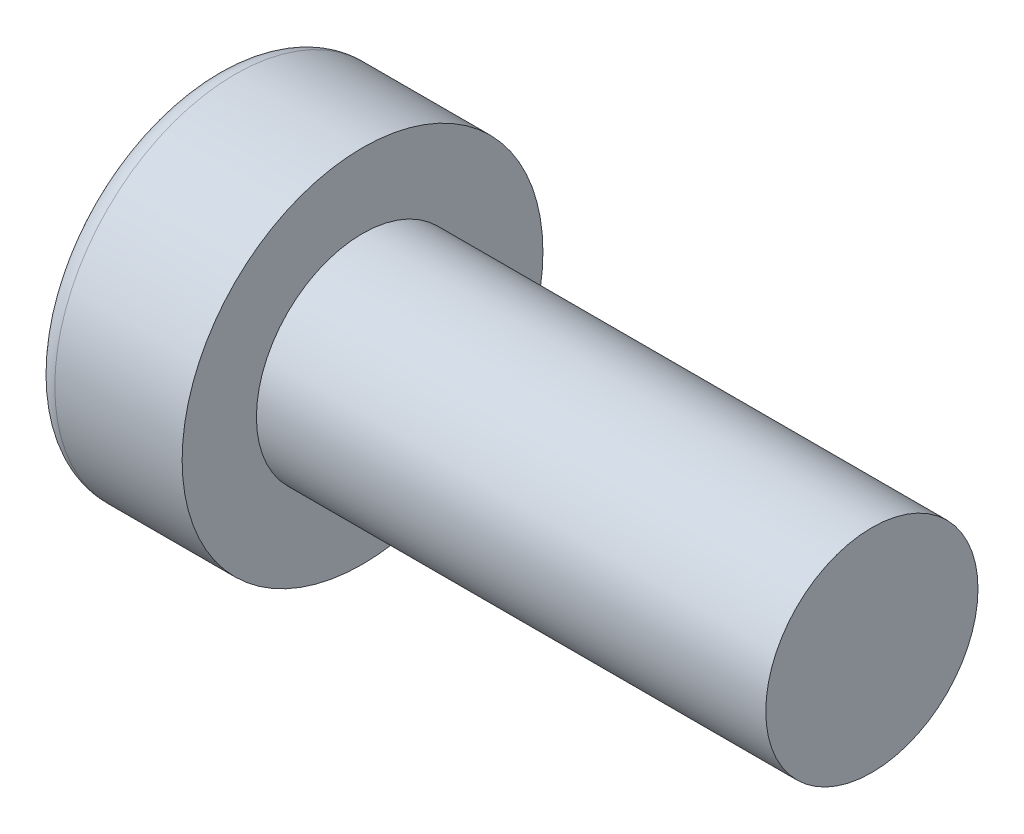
ISO-10303-21;
HEADER;
FILE_DESCRIPTION(('STEP AP214'),'2;1');
FILE_NAME('part.step','',(''),(''),'','','');
FILE_SCHEMA(('AUTOMOTIVE_DESIGN { 1 0 10303 214 1 1 1 1 }'));
ENDSEC;
DATA;
#1=APPLICATION_CONTEXT('core data for automotive mechanical design processes');
#2=APPLICATION_PROTOCOL_DEFINITION('international standard','automotive_design',2000,#1);
#3=PRODUCT_CONTEXT('',#1,'mechanical');
#4=PRODUCT('Part','Part','',(#3));
#5=PRODUCT_RELATED_PRODUCT_CATEGORY('part','',(#4));
#6=PRODUCT_DEFINITION_FORMATION('','',#4);
#7=PRODUCT_DEFINITION_CONTEXT('part definition',#1,'design');
#8=PRODUCT_DEFINITION('design','',#6,#7);
#9=PRODUCT_DEFINITION_SHAPE('','',#8);
#10=(LENGTH_UNIT() NAMED_UNIT(*) SI_UNIT(.MILLI.,.METRE.));
#11=(NAMED_UNIT(*) PLANE_ANGLE_UNIT() SI_UNIT($,.RADIAN.));
#12=(NAMED_UNIT(*) SI_UNIT($,.STERADIAN.) SOLID_ANGLE_UNIT());
#13=UNCERTAINTY_MEASURE_WITH_UNIT(LENGTH_MEASURE(1.E-05),#10,'distance_accuracy_value','');
#14=(GEOMETRIC_REPRESENTATION_CONTEXT(3) GLOBAL_UNCERTAINTY_ASSIGNED_CONTEXT((#13)) GLOBAL_UNIT_ASSIGNED_CONTEXT((#10,
#11,#12)) REPRESENTATION_CONTEXT('',''));
#15=CARTESIAN_POINT('',(0.,0.,0.));
#16=DIRECTION('',(0.,0.,1.));
#17=DIRECTION('',(1.,0.,0.));
#18=AXIS2_PLACEMENT_3D('',#15,#16,#17);
#19=CARTESIAN_POINT('',(-12.,4.25,0.));
#20=DIRECTION('',(-1.,0.,0.));
#21=DIRECTION('',(0.,0.,1.));
#22=AXIS2_PLACEMENT_3D('',#19,#20,#21);
#23=PLANE('',#22);
#24=CARTESIAN_POINT('',(-12.,0.,0.));
#25=DIRECTION('',(-1.,0.,0.));
#26=DIRECTION('',(0.,0.,1.));
#27=AXIS2_PLACEMENT_3D('',#24,#25,#26);
#28=CIRCLE('',#27,4.25);
#29=CARTESIAN_POINT('',(-12.,0.,4.25));
#30=VERTEX_POINT('',#29);
#31=EDGE_CURVE('E150',#30,#30,#28,.T.);
#32=ORIENTED_EDGE('',*,*,#31,.F.);
#33=EDGE_LOOP('',(#32));
#34=FACE_BOUND('',#33,.T.);
#35=CARTESIAN_POINT('',(-12.,0.,0.));
#36=DIRECTION('',(-1.,0.,0.));
#37=DIRECTION('',(0.,0.,1.));
#38=AXIS2_PLACEMENT_3D('',#35,#36,#37);
#39=CIRCLE('',#38,2.5);
#40=CARTESIAN_POINT('',(-12.,0.,2.5));
#41=VERTEX_POINT('',#40);
#42=EDGE_CURVE('E139',#41,#41,#39,.T.);
#43=ORIENTED_EDGE('',*,*,#42,.T.);
#44=EDGE_LOOP('',(#43));
#45=FACE_BOUND('',#44,.T.);
#46=ADVANCED_FACE('F37',(#34,#45),#23,.F.);
#47=CARTESIAN_POINT('',(-65.0118083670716,0.,0.));
#48=DIRECTION('',(-1.,0.,0.));
#49=DIRECTION('',(0.,0.,1.));
#50=AXIS2_PLACEMENT_3D('',#47,#48,#49);
#51=CYLINDRICAL_SURFACE('',#50,4.25);
#52=CARTESIAN_POINT('',(-15.,0.,0.));
#53=DIRECTION('',(1.,0.,0.));
#54=DIRECTION('',(0.,0.,-1.));
#55=AXIS2_PLACEMENT_3D('',#52,#53,#54);
#56=CIRCLE('',#55,4.25);
#57=CARTESIAN_POINT('',(-15.,0.,-4.25));
#58=VERTEX_POINT('',#57);
#59=EDGE_CURVE('E11',#58,#58,#56,.T.);
#60=ORIENTED_EDGE('',*,*,#59,.T.);
#61=EDGE_LOOP('',(#60));
#62=FACE_BOUND('',#61,.T.);
#63=ORIENTED_EDGE('',*,*,#31,.T.);
#64=EDGE_LOOP('',(#63));
#65=FACE_BOUND('',#64,.T.);
#66=ADVANCED_FACE('F172',(#62,#65),#51,.T.);
#67=CARTESIAN_POINT('',(-15.5,0.,0.));
#68=DIRECTION('',(1.,0.,0.));
#69=DIRECTION('',(0.,0.,-1.));
#70=AXIS2_PLACEMENT_3D('',#67,#68,#69);
#71=PLANE('',#70);
#72=DIRECTION('',(0.,0.5,-0.866025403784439));
#73=VECTOR('',#72,1.);
#74=CARTESIAN_POINT('',(-15.5,0.866025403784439,1.5));
#75=LINE('',#74,#73);
#76=CARTESIAN_POINT('',(-15.5,0.866025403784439,1.5));
#77=VERTEX_POINT('',#76);
#78=CARTESIAN_POINT('',(-15.5,1.73205080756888,0.));
#79=VERTEX_POINT('',#78);
#80=EDGE_CURVE('E126',#77,#79,#75,.T.);
#81=ORIENTED_EDGE('',*,*,#80,.F.);
#82=DIRECTION('',(0.,1.,0.));
#83=VECTOR('',#82,1.);
#84=CARTESIAN_POINT('',(-15.5,-0.866025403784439,1.5));
#85=LINE('',#84,#83);
#86=CARTESIAN_POINT('',(-15.5,-0.866025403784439,1.5));
#87=VERTEX_POINT('',#86);
#88=EDGE_CURVE('E52',#87,#77,#85,.T.);
#89=ORIENTED_EDGE('',*,*,#88,.F.);
#90=DIRECTION('',(0.,0.5,0.866025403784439));
#91=VECTOR('',#90,1.);
#92=CARTESIAN_POINT('',(-15.5,-1.73205080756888,0.));
#93=LINE('',#92,#91);
#94=CARTESIAN_POINT('',(-15.5,-1.73205080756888,0.));
#95=VERTEX_POINT('',#94);
#96=EDGE_CURVE('E135',#95,#87,#93,.T.);
#97=ORIENTED_EDGE('',*,*,#96,.F.);
#98=DIRECTION('',(0.,-0.5,0.866025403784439));
#99=VECTOR('',#98,1.);
#100=CARTESIAN_POINT('',(-15.5,-0.866025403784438,-1.5));
#101=LINE('',#100,#99);
#102=CARTESIAN_POINT('',(-15.5,-0.866025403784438,-1.5));
#103=VERTEX_POINT('',#102);
#104=EDGE_CURVE('E133',#103,#95,#101,.T.);
#105=ORIENTED_EDGE('',*,*,#104,.F.);
#106=DIRECTION('',(0.,-1.,0.));
#107=VECTOR('',#106,1.);
#108=CARTESIAN_POINT('',(-15.5,0.866025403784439,-1.5));
#109=LINE('',#108,#107);
#110=CARTESIAN_POINT('',(-15.5,0.866025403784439,-1.5));
#111=VERTEX_POINT('',#110);
#112=EDGE_CURVE('E100',#111,#103,#109,.T.);
#113=ORIENTED_EDGE('',*,*,#112,.F.);
#114=DIRECTION('',(0.,-0.5,-0.866025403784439));
#115=VECTOR('',#114,1.);
#116=CARTESIAN_POINT('',(-15.5,1.73205080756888,0.));
#117=LINE('',#116,#115);
#118=EDGE_CURVE('E129',#79,#111,#117,.T.);
#119=ORIENTED_EDGE('',*,*,#118,.F.);
#120=EDGE_LOOP('',(#81,#89,#97,#105,#113,#119));
#121=FACE_BOUND('',#120,.T.);
#122=CARTESIAN_POINT('',(-15.5,0.,0.));
#123=DIRECTION('',(1.,0.,0.));
#124=DIRECTION('',(0.,0.,-1.));
#125=AXIS2_PLACEMENT_3D('',#122,#123,#124);
#126=CIRCLE('',#125,3.75);
#127=CARTESIAN_POINT('',(-15.5,0.,-3.75));
#128=VERTEX_POINT('',#127);
#129=EDGE_CURVE('E45',#128,#128,#126,.F.);
#130=ORIENTED_EDGE('',*,*,#129,.T.);
#131=EDGE_LOOP('',(#130));
#132=FACE_BOUND('',#131,.T.);
#133=ADVANCED_FACE('F155',(#121,#132),#71,.F.);
#134=CARTESIAN_POINT('',(0.,2.5,0.));
#135=DIRECTION('',(-1.,0.,0.));
#136=DIRECTION('',(0.,0.,1.));
#137=AXIS2_PLACEMENT_3D('',#134,#135,#136);
#138=PLANE('',#137);
#139=CARTESIAN_POINT('',(0.,0.,0.));
#140=DIRECTION('',(-1.,0.,0.));
#141=DIRECTION('',(0.,0.,1.));
#142=AXIS2_PLACEMENT_3D('',#139,#140,#141);
#143=CIRCLE('',#142,2.5);
#144=CARTESIAN_POINT('',(0.,0.,2.5));
#145=VERTEX_POINT('',#144);
#146=EDGE_CURVE('E147',#145,#145,#143,.T.);
#147=ORIENTED_EDGE('',*,*,#146,.F.);
#148=EDGE_LOOP('',(#147));
#149=FACE_BOUND('',#148,.T.);
#150=ADVANCED_FACE('F167',(#149),#138,.F.);
#151=CARTESIAN_POINT('',(-65.0118083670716,0.,0.));
#152=DIRECTION('',(-1.,0.,0.));
#153=DIRECTION('',(0.,0.,1.));
#154=AXIS2_PLACEMENT_3D('',#151,#152,#153);
#155=CYLINDRICAL_SURFACE('',#154,2.5);
#156=ORIENTED_EDGE('',*,*,#42,.F.);
#157=EDGE_LOOP('',(#156));
#158=FACE_BOUND('',#157,.T.);
#159=ORIENTED_EDGE('',*,*,#146,.T.);
#160=EDGE_LOOP('',(#159));
#161=FACE_BOUND('',#160,.T.);
#162=ADVANCED_FACE('F159',(#158,#161),#155,.T.);
#163=CARTESIAN_POINT('',(-15.,0.,0.));
#164=DIRECTION('',(1.,0.,0.));
#165=DIRECTION('',(0.,0.,-1.));
#166=AXIS2_PLACEMENT_3D('',#163,#164,#165);
#167=TOROIDAL_SURFACE('',#166,3.75,0.5);
#168=ORIENTED_EDGE('',*,*,#59,.F.);
#169=EDGE_LOOP('',(#168));
#170=FACE_BOUND('',#169,.T.);
#171=ORIENTED_EDGE('',*,*,#129,.F.);
#172=EDGE_LOOP('',(#171));
#173=FACE_BOUND('',#172,.T.);
#174=ADVANCED_FACE('F39',(#170,#173),#167,.T.);
#175=CARTESIAN_POINT('',(-12.5,-0.866025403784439,1.5));
#176=DIRECTION('',(0.,0.,1.));
#177=DIRECTION('',(0.,-1.,0.));
#178=AXIS2_PLACEMENT_3D('',#175,#176,#177);
#179=PLANE('',#178);
#180=ORIENTED_EDGE('',*,*,#88,.T.);
#181=DIRECTION('',(-1.,0.,0.));
#182=VECTOR('',#181,1.);
#183=CARTESIAN_POINT('',(-12.5,0.866025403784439,1.5));
#184=LINE('',#183,#182);
#185=CARTESIAN_POINT('',(-12.5,0.866025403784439,1.5));
#186=VERTEX_POINT('',#185);
#187=EDGE_CURVE('E82',#186,#77,#184,.T.);
#188=ORIENTED_EDGE('',*,*,#187,.F.);
#189=DIRECTION('',(0.,1.,0.));
#190=VECTOR('',#189,1.);
#191=CARTESIAN_POINT('',(-12.5,-0.866025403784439,1.5));
#192=LINE('',#191,#190);
#193=CARTESIAN_POINT('',(-12.5,-0.866025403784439,1.5));
#194=VERTEX_POINT('',#193);
#195=EDGE_CURVE('E137',#194,#186,#192,.T.);
#196=ORIENTED_EDGE('',*,*,#195,.F.);
#197=DIRECTION('',(-1.,0.,0.));
#198=VECTOR('',#197,1.);
#199=CARTESIAN_POINT('',(-12.5,-0.866025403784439,1.5));
#200=LINE('',#199,#198);
#201=EDGE_CURVE('E60',#194,#87,#200,.T.);
#202=ORIENTED_EDGE('',*,*,#201,.T.);
#203=EDGE_LOOP('',(#180,#188,#196,#202));
#204=FACE_BOUND('',#203,.T.);
#205=ADVANCED_FACE('F158',(#204),#179,.F.);
#206=CARTESIAN_POINT('',(-12.5,-1.73205080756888,0.));
#207=DIRECTION('',(0.,-0.866025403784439,0.5));
#208=DIRECTION('',(0.,-0.5,-0.866025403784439));
#209=AXIS2_PLACEMENT_3D('',#206,#207,#208);
#210=PLANE('',#209);
#211=ORIENTED_EDGE('',*,*,#96,.T.);
#212=ORIENTED_EDGE('',*,*,#201,.F.);
#213=DIRECTION('',(0.,0.5,0.866025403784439));
#214=VECTOR('',#213,1.);
#215=CARTESIAN_POINT('',(-12.5,-1.73205080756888,0.));
#216=LINE('',#215,#214);
#217=CARTESIAN_POINT('',(-12.5,-1.73205080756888,0.));
#218=VERTEX_POINT('',#217);
#219=EDGE_CURVE('E112',#218,#194,#216,.T.);
#220=ORIENTED_EDGE('',*,*,#219,.F.);
#221=DIRECTION('',(-1.,0.,0.));
#222=VECTOR('',#221,1.);
#223=CARTESIAN_POINT('',(-12.5,-1.73205080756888,0.));
#224=LINE('',#223,#222);
#225=EDGE_CURVE('E104',#218,#95,#224,.T.);
#226=ORIENTED_EDGE('',*,*,#225,.T.);
#227=EDGE_LOOP('',(#211,#212,#220,#226));
#228=FACE_BOUND('',#227,.T.);
#229=ADVANCED_FACE('F165',(#228),#210,.F.);
#230=CARTESIAN_POINT('',(-12.5,-0.866025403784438,-1.5));
#231=DIRECTION('',(0.,-0.866025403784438,-0.5));
#232=DIRECTION('',(0.,0.5,-0.866025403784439));
#233=AXIS2_PLACEMENT_3D('',#230,#231,#232);
#234=PLANE('',#233);
#235=ORIENTED_EDGE('',*,*,#104,.T.);
#236=ORIENTED_EDGE('',*,*,#225,.F.);
#237=DIRECTION('',(0.,-0.5,0.866025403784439));
#238=VECTOR('',#237,1.);
#239=CARTESIAN_POINT('',(-12.5,-0.866025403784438,-1.5));
#240=LINE('',#239,#238);
#241=CARTESIAN_POINT('',(-12.5,-0.866025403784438,-1.5));
#242=VERTEX_POINT('',#241);
#243=EDGE_CURVE('E108',#242,#218,#240,.T.);
#244=ORIENTED_EDGE('',*,*,#243,.F.);
#245=DIRECTION('',(-1.,0.,0.));
#246=VECTOR('',#245,1.);
#247=CARTESIAN_POINT('',(-12.5,-0.866025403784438,-1.5));
#248=LINE('',#247,#246);
#249=EDGE_CURVE('E93',#242,#103,#248,.T.);
#250=ORIENTED_EDGE('',*,*,#249,.T.);
#251=EDGE_LOOP('',(#235,#236,#244,#250));
#252=FACE_BOUND('',#251,.T.);
#253=ADVANCED_FACE('F109',(#252),#234,.F.);
#254=CARTESIAN_POINT('',(-12.5,0.866025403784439,-1.5));
#255=DIRECTION('',(0.,0.,-1.));
#256=DIRECTION('',(-1.,0.,0.));
#257=AXIS2_PLACEMENT_3D('',#254,#255,#256);
#258=PLANE('',#257);
#259=ORIENTED_EDGE('',*,*,#112,.T.);
#260=ORIENTED_EDGE('',*,*,#249,.F.);
#261=DIRECTION('',(0.,-1.,0.));
#262=VECTOR('',#261,1.);
#263=CARTESIAN_POINT('',(-12.5,0.866025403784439,-1.5));
#264=LINE('',#263,#262);
#265=CARTESIAN_POINT('',(-12.5,0.866025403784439,-1.5));
#266=VERTEX_POINT('',#265);
#267=EDGE_CURVE('E97',#266,#242,#264,.T.);
#268=ORIENTED_EDGE('',*,*,#267,.F.);
#269=DIRECTION('',(-1.,0.,0.));
#270=VECTOR('',#269,1.);
#271=CARTESIAN_POINT('',(-12.5,0.866025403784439,-1.5));
#272=LINE('',#271,#270);
#273=EDGE_CURVE('E105',#266,#111,#272,.T.);
#274=ORIENTED_EDGE('',*,*,#273,.T.);
#275=EDGE_LOOP('',(#259,#260,#268,#274));
#276=FACE_BOUND('',#275,.T.);
#277=ADVANCED_FACE('F95',(#276),#258,.F.);
#278=CARTESIAN_POINT('',(-12.5,1.73205080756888,0.));
#279=DIRECTION('',(0.,0.866025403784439,-0.5));
#280=DIRECTION('',(0.,0.5,0.866025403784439));
#281=AXIS2_PLACEMENT_3D('',#278,#279,#280);
#282=PLANE('',#281);
#283=ORIENTED_EDGE('',*,*,#118,.T.);
#284=ORIENTED_EDGE('',*,*,#273,.F.);
#285=DIRECTION('',(0.,-0.5,-0.866025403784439));
#286=VECTOR('',#285,1.);
#287=CARTESIAN_POINT('',(-12.5,1.73205080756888,0.));
#288=LINE('',#287,#286);
#289=CARTESIAN_POINT('',(-12.5,1.73205080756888,0.));
#290=VERTEX_POINT('',#289);
#291=EDGE_CURVE('E118',#290,#266,#288,.T.);
#292=ORIENTED_EDGE('',*,*,#291,.F.);
#293=DIRECTION('',(-1.,0.,0.));
#294=VECTOR('',#293,1.);
#295=CARTESIAN_POINT('',(-12.5,1.73205080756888,0.));
#296=LINE('',#295,#294);
#297=EDGE_CURVE('E142',#290,#79,#296,.T.);
#298=ORIENTED_EDGE('',*,*,#297,.T.);
#299=EDGE_LOOP('',(#283,#284,#292,#298));
#300=FACE_BOUND('',#299,.T.);
#301=ADVANCED_FACE('F191',(#300),#282,.F.);
#302=CARTESIAN_POINT('',(-12.5,0.866025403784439,1.5));
#303=DIRECTION('',(0.,0.866025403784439,0.5));
#304=DIRECTION('',(0.,-0.5,0.866025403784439));
#305=AXIS2_PLACEMENT_3D('',#302,#303,#304);
#306=PLANE('',#305);
#307=ORIENTED_EDGE('',*,*,#80,.T.);
#308=ORIENTED_EDGE('',*,*,#297,.F.);
#309=DIRECTION('',(0.,0.5,-0.866025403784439));
#310=VECTOR('',#309,1.);
#311=CARTESIAN_POINT('',(-12.5,0.866025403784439,1.5));
#312=LINE('',#311,#310);
#313=EDGE_CURVE('E120',#186,#290,#312,.T.);
#314=ORIENTED_EDGE('',*,*,#313,.F.);
#315=ORIENTED_EDGE('',*,*,#187,.T.);
#316=EDGE_LOOP('',(#307,#308,#314,#315));
#317=FACE_BOUND('',#316,.T.);
#318=ADVANCED_FACE('F188',(#317),#306,.F.);
#319=CARTESIAN_POINT('',(-12.5,0.,0.));
#320=DIRECTION('',(-1.,0.,0.));
#321=DIRECTION('',(0.,0.,1.));
#322=AXIS2_PLACEMENT_3D('',#319,#320,#321);
#323=PLANE('',#322);
#324=ORIENTED_EDGE('',*,*,#195,.T.);
#325=ORIENTED_EDGE('',*,*,#313,.T.);
#326=ORIENTED_EDGE('',*,*,#291,.T.);
#327=ORIENTED_EDGE('',*,*,#267,.T.);
#328=ORIENTED_EDGE('',*,*,#243,.T.);
#329=ORIENTED_EDGE('',*,*,#219,.T.);
#330=EDGE_LOOP('',(#324,#325,#326,#327,#328,#329));
#331=FACE_BOUND('',#330,.T.);
#332=ADVANCED_FACE('F115',(#331),#323,.T.);
#333=CLOSED_SHELL('',(#46,#66,#133,#150,#162,#174,#205,#229,#253,#277,#301,#318,#332));
#334=MANIFOLD_SOLID_BREP('B2',#333);
#335=ADVANCED_BREP_SHAPE_REPRESENTATION('',(#18,#334),#14);
#336=SHAPE_DEFINITION_REPRESENTATION(#9,#335);
ENDSEC;
END-ISO-10303-21;
